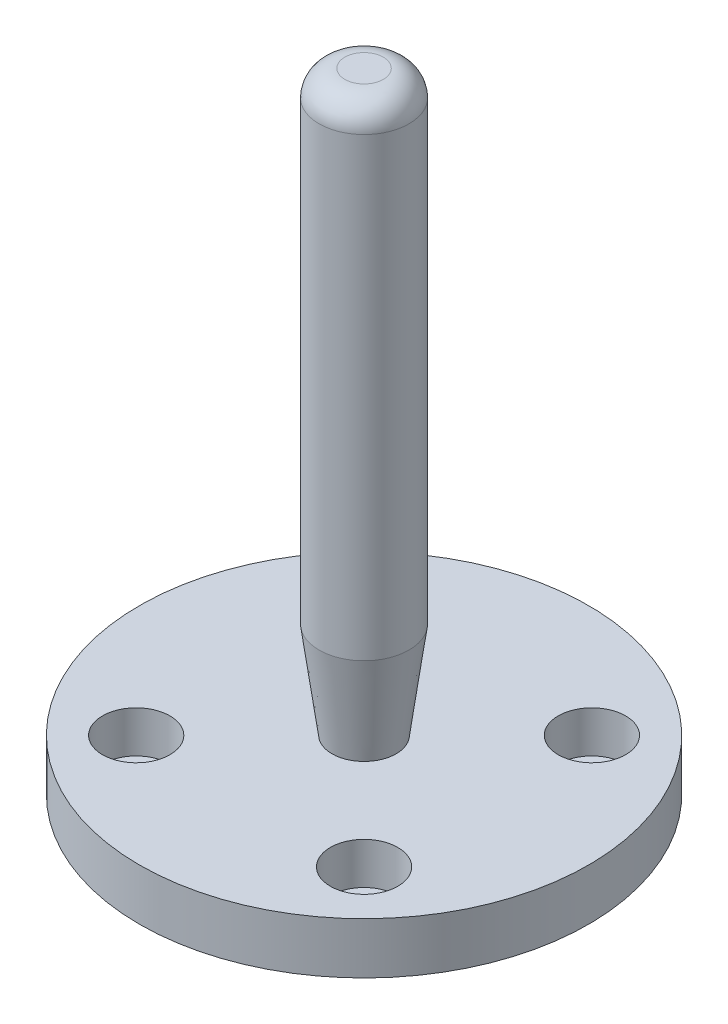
from build123d import *

# Parameters (mm, degrees)
SKETCH1_R           = 35
BOSS_EXTRUDE1_DEPTH = 8
SKETCH2_R           = 5.25
CUT_EXTRUDE1_DEPTH  = 6.5
SKETCH3_R           = 3.25
CUT_EXTRUDE2_DEPTH  = 2
FILLET2_R           = 4


with BuildPart() as part:
    # Sketch1 → Boss-Extrude1 (new body)
    with BuildSketch(Plane(origin=(0, 0, 0), x_dir=(1, 0, 0), z_dir=(0, 1, 0))):
        with Locations(Location((0, 0, 0), (0, 0, 270))):
            Circle(SKETCH1_R)
    extrude(amount=BOSS_EXTRUDE1_DEPTH)

    # Sketch2 → Cut-Extrude1 (cut)
    with BuildSketch(Plane(origin=(0, 8, 0), x_dir=(1, 0, 0), z_dir=(0, 1, 0))):
        with Locations(Location((-17.75, 17.75, 0), (0, 0, 270))):
            Circle(SKETCH2_R)
        with Locations(Location((17.75, 17.75, 0), (0, 0, 270))):
            Circle(SKETCH2_R)
        with Locations(Location((17.75, -17.75, 0), (0, 0, 270))):
            Circle(SKETCH2_R)
        with Locations(Location((-17.75, -17.75, 0), (0, 0, 270))):
            Circle(SKETCH2_R)
    extrude(amount=-CUT_EXTRUDE1_DEPTH, mode=Mode.SUBTRACT)

    # Sketch3 → Cut-Extrude2 (cut)
    with BuildSketch(Plane(origin=(0, 1.5, 0), x_dir=(1, 0, 0), z_dir=(0, 1, 0))):
        with Locations(Location((17.75, 17.75, 0), (0, 0, 270))):
            Circle(SKETCH3_R)
        with Locations(Location((-17.75, 17.75, 0), (0, 0, 270))):
            Circle(SKETCH3_R)
        with Locations(Location((-17.75, -17.75, 0), (0, 0, 270))):
            Circle(SKETCH3_R)
        with Locations(Location((17.75, -17.75, 0), (0, 0, 270))):
            Circle(SKETCH3_R)
    extrude(amount=-CUT_EXTRUDE2_DEPTH, mode=Mode.SUBTRACT)

    # Sketch4 → Revolve1 (revolve)
    with BuildSketch(Plane.XY, mode=Mode.PRIVATE) as revolve1_sk:
        Polygon((0, 8), (0, 98), (7, 98), (7, 23), (5, 8), align=None)
    revolve(revolve1_sk.sketch.rotate(Axis((0, 8, 0), (0, 1, 0)), 90), axis=Axis((0, 8, 0), (0, 1, 0)))

    # Fillet2
    fillet2_edges = [part.edges().sort_by_distance(p)[0] for p in [
        (0, 98, 7),
    ]]
    fillet(fillet2_edges, radius=FILLET2_R)


solid = part.part
